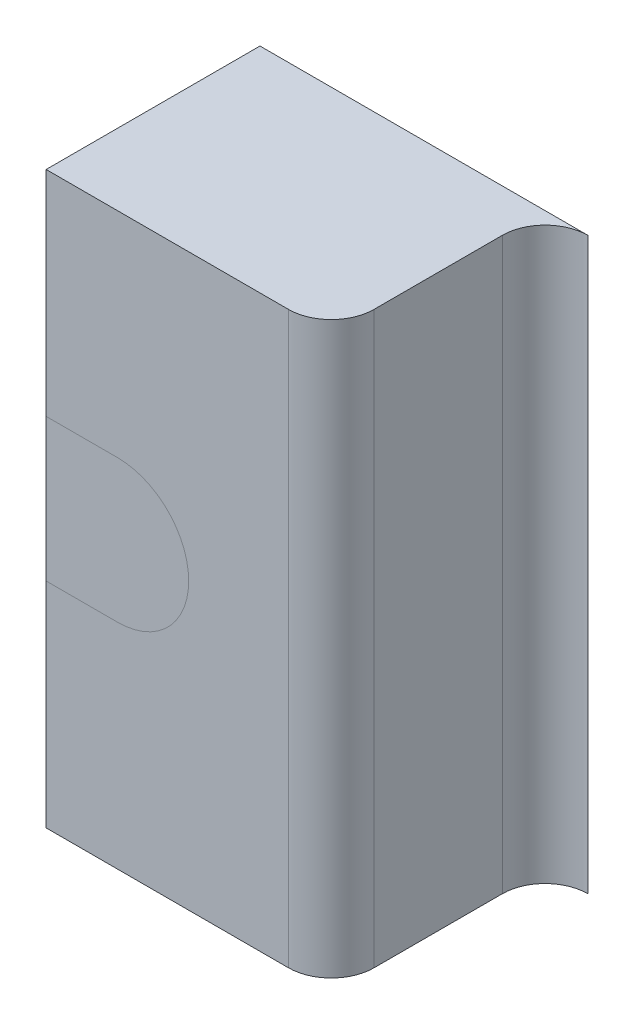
ISO-10303-21;
HEADER;
FILE_DESCRIPTION(('STEP AP214'),'2;1');
FILE_NAME('part.step','',(''),(''),'','','');
FILE_SCHEMA(('AUTOMOTIVE_DESIGN { 1 0 10303 214 1 1 1 1 }'));
ENDSEC;
DATA;
#1=APPLICATION_CONTEXT('core data for automotive mechanical design processes');
#2=APPLICATION_PROTOCOL_DEFINITION('international standard','automotive_design',2000,#1);
#3=PRODUCT_CONTEXT('',#1,'mechanical');
#4=PRODUCT('Part','Part','',(#3));
#5=PRODUCT_RELATED_PRODUCT_CATEGORY('part','',(#4));
#6=PRODUCT_DEFINITION_FORMATION('','',#4);
#7=PRODUCT_DEFINITION_CONTEXT('part definition',#1,'design');
#8=PRODUCT_DEFINITION('design','',#6,#7);
#9=PRODUCT_DEFINITION_SHAPE('','',#8);
#10=(LENGTH_UNIT() NAMED_UNIT(*) SI_UNIT(.MILLI.,.METRE.));
#11=(NAMED_UNIT(*) PLANE_ANGLE_UNIT() SI_UNIT($,.RADIAN.));
#12=(NAMED_UNIT(*) SI_UNIT($,.STERADIAN.) SOLID_ANGLE_UNIT());
#13=UNCERTAINTY_MEASURE_WITH_UNIT(LENGTH_MEASURE(1.E-05),#10,'distance_accuracy_value','');
#14=(GEOMETRIC_REPRESENTATION_CONTEXT(3) GLOBAL_UNCERTAINTY_ASSIGNED_CONTEXT((#13)) GLOBAL_UNIT_ASSIGNED_CONTEXT((#10,
#11,#12)) REPRESENTATION_CONTEXT('',''));
#15=CARTESIAN_POINT('',(0.,0.,0.));
#16=DIRECTION('',(0.,0.,1.));
#17=DIRECTION('',(1.,0.,0.));
#18=AXIS2_PLACEMENT_3D('',#15,#16,#17);
#19=CARTESIAN_POINT('',(0.,0.,25.));
#20=DIRECTION('',(0.,0.,1.));
#21=DIRECTION('',(1.,0.,0.));
#22=AXIS2_PLACEMENT_3D('',#19,#20,#21);
#23=PLANE('',#22);
#24=CARTESIAN_POINT('',(-13.,28.3859449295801,25.));
#25=DIRECTION('',(0.,0.,1.));
#26=DIRECTION('',(1.,0.,0.));
#27=AXIS2_PLACEMENT_3D('',#24,#25,#26);
#28=CIRCLE('',#27,5.);
#29=CARTESIAN_POINT('',(-13.,33.3859449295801,25.));
#30=VERTEX_POINT('',#29);
#31=CARTESIAN_POINT('',(-13.,23.3859449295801,25.));
#32=VERTEX_POINT('',#31);
#33=EDGE_CURVE('E46',#30,#32,#28,.F.);
#34=ORIENTED_EDGE('',*,*,#33,.T.);
#35=DIRECTION('',(-1.,0.,0.));
#36=VECTOR('',#35,1.);
#37=CARTESIAN_POINT('',(0.,23.3859449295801,25.));
#38=LINE('',#37,#36);
#39=CARTESIAN_POINT('',(-18.,23.3859449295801,25.));
#40=VERTEX_POINT('',#39);
#41=EDGE_CURVE('E12',#32,#40,#38,.T.);
#42=ORIENTED_EDGE('',*,*,#41,.T.);
#43=DIRECTION('',(0.,-1.,0.));
#44=VECTOR('',#43,1.);
#45=CARTESIAN_POINT('',(-18.,48.3859449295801,25.));
#46=LINE('',#45,#44);
#47=CARTESIAN_POINT('',(-18.,8.38594492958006,25.));
#48=VERTEX_POINT('',#47);
#49=EDGE_CURVE('E146',#40,#48,#46,.T.);
#50=ORIENTED_EDGE('',*,*,#49,.T.);
#51=DIRECTION('',(1.,0.,0.));
#52=VECTOR('',#51,1.);
#53=CARTESIAN_POINT('',(-18.,8.38594492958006,25.));
#54=LINE('',#53,#52);
#55=CARTESIAN_POINT('',(-0.999999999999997,8.38594492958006,25.));
#56=VERTEX_POINT('',#55);
#57=EDGE_CURVE('E148',#48,#56,#54,.T.);
#58=ORIENTED_EDGE('',*,*,#57,.T.);
#59=DIRECTION('',(0.,1.,0.));
#60=VECTOR('',#59,1.);
#61=CARTESIAN_POINT('',(-0.999999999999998,48.3859449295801,25.));
#62=LINE('',#61,#60);
#63=CARTESIAN_POINT('',(-0.999999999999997,48.3859449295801,25.));
#64=VERTEX_POINT('',#63);
#65=EDGE_CURVE('E107',#56,#64,#62,.T.);
#66=ORIENTED_EDGE('',*,*,#65,.T.);
#67=DIRECTION('',(-1.,0.,0.));
#68=VECTOR('',#67,1.);
#69=CARTESIAN_POINT('',(-18.,48.3859449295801,25.));
#70=LINE('',#69,#68);
#71=CARTESIAN_POINT('',(-18.,48.3859449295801,25.));
#72=VERTEX_POINT('',#71);
#73=EDGE_CURVE('E152',#64,#72,#70,.T.);
#74=ORIENTED_EDGE('',*,*,#73,.T.);
#75=CARTESIAN_POINT('',(-18.,33.3859449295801,25.));
#76=VERTEX_POINT('',#75);
#77=EDGE_CURVE('E139',#72,#76,#46,.T.);
#78=ORIENTED_EDGE('',*,*,#77,.T.);
#79=DIRECTION('',(1.,0.,0.));
#80=VECTOR('',#79,1.);
#81=CARTESIAN_POINT('',(0.,33.3859449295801,25.));
#82=LINE('',#81,#80);
#83=EDGE_CURVE('E124',#76,#30,#82,.T.);
#84=ORIENTED_EDGE('',*,*,#83,.T.);
#85=EDGE_LOOP('',(#34,#42,#50,#58,#66,#74,#78,#84));
#86=FACE_BOUND('',#85,.T.);
#87=ADVANCED_FACE('F37',(#86),#23,.T.);
#88=CARTESIAN_POINT('',(0.,0.,10.));
#89=DIRECTION('',(0.,0.,1.));
#90=DIRECTION('',(1.,0.,0.));
#91=AXIS2_PLACEMENT_3D('',#88,#89,#90);
#92=PLANE('',#91);
#93=DIRECTION('',(0.,-1.,0.));
#94=VECTOR('',#93,1.);
#95=CARTESIAN_POINT('',(-18.,48.3859449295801,10.));
#96=LINE('',#95,#94);
#97=CARTESIAN_POINT('',(-18.,48.3859449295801,10.));
#98=VERTEX_POINT('',#97);
#99=CARTESIAN_POINT('',(-18.,8.38594492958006,10.));
#100=VERTEX_POINT('',#99);
#101=EDGE_CURVE('E155',#98,#100,#96,.T.);
#102=ORIENTED_EDGE('',*,*,#101,.F.);
#103=DIRECTION('',(-1.,0.,0.));
#104=VECTOR('',#103,1.);
#105=CARTESIAN_POINT('',(-18.,48.3859449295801,10.));
#106=LINE('',#105,#104);
#107=CARTESIAN_POINT('',(5.,48.3859449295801,10.));
#108=VERTEX_POINT('',#107);
#109=EDGE_CURVE('E103',#108,#98,#106,.T.);
#110=ORIENTED_EDGE('',*,*,#109,.F.);
#111=DIRECTION('',(0.,1.,0.));
#112=VECTOR('',#111,1.);
#113=CARTESIAN_POINT('',(5.,8.38594492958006,10.));
#114=LINE('',#113,#112);
#115=CARTESIAN_POINT('',(5.,8.38594492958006,10.));
#116=VERTEX_POINT('',#115);
#117=EDGE_CURVE('E97',#108,#116,#114,.F.);
#118=ORIENTED_EDGE('',*,*,#117,.T.);
#119=DIRECTION('',(1.,0.,0.));
#120=VECTOR('',#119,1.);
#121=CARTESIAN_POINT('',(-18.,8.38594492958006,10.));
#122=LINE('',#121,#120);
#123=EDGE_CURVE('E101',#100,#116,#122,.T.);
#124=ORIENTED_EDGE('',*,*,#123,.F.);
#125=EDGE_LOOP('',(#102,#110,#118,#124));
#126=FACE_BOUND('',#125,.T.);
#127=ADVANCED_FACE('F100',(#126),#92,.F.);
#128=CARTESIAN_POINT('',(-18.,48.3859449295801,25.));
#129=DIRECTION('',(1.,0.,0.));
#130=DIRECTION('',(0.,1.,0.));
#131=AXIS2_PLACEMENT_3D('',#128,#129,#130);
#132=PLANE('',#131);
#133=ORIENTED_EDGE('',*,*,#101,.T.);
#134=DIRECTION('',(0.,0.,-1.));
#135=VECTOR('',#134,1.);
#136=CARTESIAN_POINT('',(-18.,8.38594492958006,25.));
#137=LINE('',#136,#135);
#138=EDGE_CURVE('E117',#48,#100,#137,.T.);
#139=ORIENTED_EDGE('',*,*,#138,.F.);
#140=ORIENTED_EDGE('',*,*,#49,.F.);
#141=EDGE_CURVE('E142',#76,#40,#46,.T.);
#142=ORIENTED_EDGE('',*,*,#141,.F.);
#143=ORIENTED_EDGE('',*,*,#77,.F.);
#144=DIRECTION('',(0.,0.,-1.));
#145=VECTOR('',#144,1.);
#146=CARTESIAN_POINT('',(-18.,48.3859449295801,25.));
#147=LINE('',#146,#145);
#148=EDGE_CURVE('E154',#72,#98,#147,.T.);
#149=ORIENTED_EDGE('',*,*,#148,.T.);
#150=EDGE_LOOP('',(#133,#139,#140,#142,#143,#149));
#151=FACE_BOUND('',#150,.T.);
#152=ADVANCED_FACE('F144',(#151),#132,.F.);
#153=CARTESIAN_POINT('',(-18.,8.38594492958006,25.));
#154=DIRECTION('',(0.,1.,0.));
#155=DIRECTION('',(0.,0.,1.));
#156=AXIS2_PLACEMENT_3D('',#153,#154,#155);
#157=PLANE('',#156);
#158=DIRECTION('',(0.,0.,-1.));
#159=VECTOR('',#158,1.);
#160=CARTESIAN_POINT('',(2.,8.38594492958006,25.));
#161=LINE('',#160,#159);
#162=CARTESIAN_POINT('',(2.,8.38594492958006,22.));
#163=VERTEX_POINT('',#162);
#164=CARTESIAN_POINT('',(2.,8.38594492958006,13.));
#165=VERTEX_POINT('',#164);
#166=EDGE_CURVE('E162',#163,#165,#161,.T.);
#167=ORIENTED_EDGE('',*,*,#166,.F.);
#168=CARTESIAN_POINT('',(-0.999999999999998,8.38594492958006,22.));
#169=DIRECTION('',(0.,1.,0.));
#170=DIRECTION('',(0.,0.,1.));
#171=AXIS2_PLACEMENT_3D('',#168,#169,#170);
#172=CIRCLE('',#171,3.);
#173=EDGE_CURVE('E129',#163,#56,#172,.F.);
#174=ORIENTED_EDGE('',*,*,#173,.T.);
#175=ORIENTED_EDGE('',*,*,#57,.F.);
#176=ORIENTED_EDGE('',*,*,#138,.T.);
#177=ORIENTED_EDGE('',*,*,#123,.T.);
#178=CARTESIAN_POINT('',(5.,8.38594492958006,13.));
#179=DIRECTION('',(0.,1.,0.));
#180=DIRECTION('',(0.,0.,1.));
#181=AXIS2_PLACEMENT_3D('',#178,#179,#180);
#182=CIRCLE('',#181,3.);
#183=EDGE_CURVE('E113',#116,#165,#182,.T.);
#184=ORIENTED_EDGE('',*,*,#183,.T.);
#185=EDGE_LOOP('',(#167,#174,#175,#176,#177,#184));
#186=FACE_BOUND('',#185,.T.);
#187=ADVANCED_FACE('F112',(#186),#157,.F.);
#188=CARTESIAN_POINT('',(2.,48.3859449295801,25.));
#189=DIRECTION('',(-1.,0.,0.));
#190=DIRECTION('',(0.,0.,1.));
#191=AXIS2_PLACEMENT_3D('',#188,#189,#190);
#192=PLANE('',#191);
#193=ORIENTED_EDGE('',*,*,#166,.T.);
#194=DIRECTION('',(0.,1.,0.));
#195=VECTOR('',#194,1.);
#196=CARTESIAN_POINT('',(2.,48.3859449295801,13.));
#197=LINE('',#196,#195);
#198=CARTESIAN_POINT('',(2.,48.3859449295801,13.));
#199=VERTEX_POINT('',#198);
#200=EDGE_CURVE('E108',#165,#199,#197,.T.);
#201=ORIENTED_EDGE('',*,*,#200,.T.);
#202=DIRECTION('',(0.,0.,-1.));
#203=VECTOR('',#202,1.);
#204=CARTESIAN_POINT('',(2.,48.3859449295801,25.));
#205=LINE('',#204,#203);
#206=CARTESIAN_POINT('',(2.,48.3859449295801,22.));
#207=VERTEX_POINT('',#206);
#208=EDGE_CURVE('E159',#207,#199,#205,.T.);
#209=ORIENTED_EDGE('',*,*,#208,.F.);
#210=DIRECTION('',(0.,1.,0.));
#211=VECTOR('',#210,1.);
#212=CARTESIAN_POINT('',(2.,8.38594492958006,22.));
#213=LINE('',#212,#211);
#214=EDGE_CURVE('E119',#207,#163,#213,.F.);
#215=ORIENTED_EDGE('',*,*,#214,.T.);
#216=EDGE_LOOP('',(#193,#201,#209,#215));
#217=FACE_BOUND('',#216,.T.);
#218=ADVANCED_FACE('F180',(#217),#192,.F.);
#219=CARTESIAN_POINT('',(-18.,48.3859449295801,25.));
#220=DIRECTION('',(0.,-1.,0.));
#221=DIRECTION('',(1.,0.,0.));
#222=AXIS2_PLACEMENT_3D('',#219,#220,#221);
#223=PLANE('',#222);
#224=ORIENTED_EDGE('',*,*,#73,.F.);
#225=CARTESIAN_POINT('',(-0.999999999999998,48.3859449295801,22.));
#226=DIRECTION('',(0.,-1.,0.));
#227=DIRECTION('',(1.,0.,0.));
#228=AXIS2_PLACEMENT_3D('',#225,#226,#227);
#229=CIRCLE('',#228,3.);
#230=EDGE_CURVE('E169',#64,#207,#229,.F.);
#231=ORIENTED_EDGE('',*,*,#230,.T.);
#232=ORIENTED_EDGE('',*,*,#208,.T.);
#233=CARTESIAN_POINT('',(5.,48.3859449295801,13.));
#234=DIRECTION('',(0.,-1.,0.));
#235=DIRECTION('',(1.,0.,0.));
#236=AXIS2_PLACEMENT_3D('',#233,#234,#235);
#237=CIRCLE('',#236,3.);
#238=EDGE_CURVE('E125',#199,#108,#237,.T.);
#239=ORIENTED_EDGE('',*,*,#238,.T.);
#240=ORIENTED_EDGE('',*,*,#109,.T.);
#241=ORIENTED_EDGE('',*,*,#148,.F.);
#242=EDGE_LOOP('',(#224,#231,#232,#239,#240,#241));
#243=FACE_BOUND('',#242,.T.);
#244=ADVANCED_FACE('F177',(#243),#223,.F.);
#245=ORIENTED_EDGE('',*,*,#41,.F.);
#246=ORIENTED_EDGE('',*,*,#33,.F.);
#247=ORIENTED_EDGE('',*,*,#83,.F.);
#248=ORIENTED_EDGE('',*,*,#141,.T.);
#249=EDGE_LOOP('',(#245,#246,#247,#248));
#250=FACE_BOUND('',#249,.T.);
#251=ADVANCED_FACE('F141',(#250),#23,.T.);
#252=CARTESIAN_POINT('',(5.,48.3859449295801,13.));
#253=DIRECTION('',(0.,-1.,0.));
#254=DIRECTION('',(0.,0.,-1.));
#255=AXIS2_PLACEMENT_3D('',#252,#253,#254);
#256=CYLINDRICAL_SURFACE('',#255,3.);
#257=ORIENTED_EDGE('',*,*,#183,.F.);
#258=ORIENTED_EDGE('',*,*,#117,.F.);
#259=ORIENTED_EDGE('',*,*,#238,.F.);
#260=ORIENTED_EDGE('',*,*,#200,.F.);
#261=EDGE_LOOP('',(#257,#258,#259,#260));
#262=FACE_BOUND('',#261,.T.);
#263=ADVANCED_FACE('F122',(#262),#256,.F.);
#264=CARTESIAN_POINT('',(-0.999999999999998,0.,22.));
#265=DIRECTION('',(0.,-1.,0.));
#266=DIRECTION('',(0.,0.,-1.));
#267=AXIS2_PLACEMENT_3D('',#264,#265,#266);
#268=CYLINDRICAL_SURFACE('',#267,3.);
#269=ORIENTED_EDGE('',*,*,#173,.F.);
#270=ORIENTED_EDGE('',*,*,#214,.F.);
#271=ORIENTED_EDGE('',*,*,#230,.F.);
#272=ORIENTED_EDGE('',*,*,#65,.F.);
#273=EDGE_LOOP('',(#269,#270,#271,#272));
#274=FACE_BOUND('',#273,.T.);
#275=ADVANCED_FACE('F39',(#274),#268,.T.);
#276=CLOSED_SHELL('',(#87,#127,#152,#187,#218,#244,#251,#263,#275));
#277=MANIFOLD_SOLID_BREP('B2',#276);
#278=ADVANCED_BREP_SHAPE_REPRESENTATION('',(#18,#277),#14);
#279=SHAPE_DEFINITION_REPRESENTATION(#9,#278);
ENDSEC;
END-ISO-10303-21;
